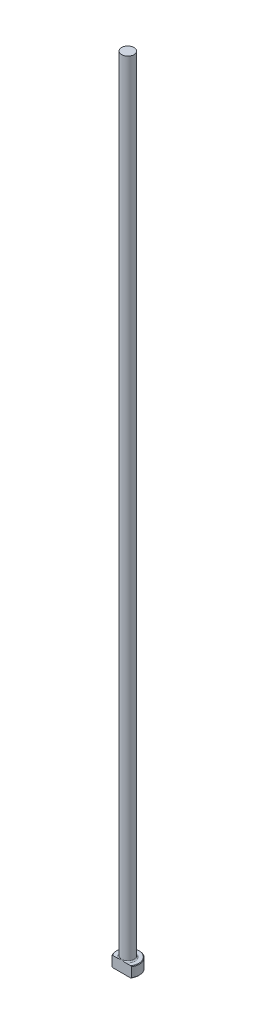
ISO-10303-21;
HEADER;
FILE_DESCRIPTION(('STEP AP214'),'2;1');
FILE_NAME('part.step','',(''),(''),'','','');
FILE_SCHEMA(('AUTOMOTIVE_DESIGN { 1 0 10303 214 1 1 1 1 }'));
ENDSEC;
DATA;
#1=APPLICATION_CONTEXT('core data for automotive mechanical design processes');
#2=APPLICATION_PROTOCOL_DEFINITION('international standard','automotive_design',2000,#1);
#3=PRODUCT_CONTEXT('',#1,'mechanical');
#4=PRODUCT('Part','Part','',(#3));
#5=PRODUCT_RELATED_PRODUCT_CATEGORY('part','',(#4));
#6=PRODUCT_DEFINITION_FORMATION('','',#4);
#7=PRODUCT_DEFINITION_CONTEXT('part definition',#1,'design');
#8=PRODUCT_DEFINITION('design','',#6,#7);
#9=PRODUCT_DEFINITION_SHAPE('','',#8);
#10=(LENGTH_UNIT() NAMED_UNIT(*) SI_UNIT(.MILLI.,.METRE.));
#11=(NAMED_UNIT(*) PLANE_ANGLE_UNIT() SI_UNIT($,.RADIAN.));
#12=(NAMED_UNIT(*) SI_UNIT($,.STERADIAN.) SOLID_ANGLE_UNIT());
#13=UNCERTAINTY_MEASURE_WITH_UNIT(LENGTH_MEASURE(1.E-05),#10,'distance_accuracy_value','');
#14=(GEOMETRIC_REPRESENTATION_CONTEXT(3) GLOBAL_UNCERTAINTY_ASSIGNED_CONTEXT((#13)) GLOBAL_UNIT_ASSIGNED_CONTEXT((#10,
#11,#12)) REPRESENTATION_CONTEXT('',''));
#15=CARTESIAN_POINT('',(0.,0.,0.));
#16=DIRECTION('',(0.,0.,1.));
#17=DIRECTION('',(1.,0.,0.));
#18=AXIS2_PLACEMENT_3D('',#15,#16,#17);
#19=CARTESIAN_POINT('',(0.,0.,0.));
#20=DIRECTION('',(0.,-1.,0.));
#21=DIRECTION('',(0.,0.,-1.));
#22=AXIS2_PLACEMENT_3D('',#19,#20,#21);
#23=PLANE('',#22);
#24=CARTESIAN_POINT('',(0.,0.,0.));
#25=DIRECTION('',(0.,-1.,0.));
#26=DIRECTION('',(0.,0.,-1.));
#27=AXIS2_PLACEMENT_3D('',#24,#25,#26);
#28=CIRCLE('',#27,4.90219999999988);
#29=CARTESIAN_POINT('',(-4.03944478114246,0.,2.77748999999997));
#30=VERTEX_POINT('',#29);
#31=CARTESIAN_POINT('',(4.03944478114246,0.,2.77748999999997));
#32=VERTEX_POINT('',#31);
#33=EDGE_CURVE('E98',#30,#32,#28,.T.);
#34=ORIENTED_EDGE('',*,*,#33,.T.);
#35=DIRECTION('',(-1.,0.,0.));
#36=VECTOR('',#35,1.);
#37=CARTESIAN_POINT('',(-4.34418550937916,0.,2.77748999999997));
#38=LINE('',#37,#36);
#39=EDGE_CURVE('E83',#32,#30,#38,.T.);
#40=ORIENTED_EDGE('',*,*,#39,.T.);
#41=EDGE_LOOP('',(#34,#40));
#42=FACE_BOUND('',#41,.T.);
#43=ADVANCED_FACE('F32',(#42),#23,.T.);
#44=CARTESIAN_POINT('',(0.,259.958771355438,0.));
#45=DIRECTION('',(0.,1.,0.));
#46=DIRECTION('',(0.,0.,1.));
#47=AXIS2_PLACEMENT_3D('',#44,#45,#46);
#48=CYLINDRICAL_SURFACE('',#47,5.15619999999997);
#49=CARTESIAN_POINT('',(0.,4.49580000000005,0.));
#50=DIRECTION('',(0.,1.,0.));
#51=DIRECTION('',(0.,0.,1.));
#52=AXIS2_PLACEMENT_3D('',#49,#50,#51);
#53=CIRCLE('',#52,5.15619999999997);
#54=CARTESIAN_POINT('',(-4.34418550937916,4.49580000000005,2.77748999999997));
#55=VERTEX_POINT('',#54);
#56=CARTESIAN_POINT('',(4.34418550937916,4.49580000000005,2.77748999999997));
#57=VERTEX_POINT('',#56);
#58=EDGE_CURVE('E104',#55,#57,#53,.F.);
#59=ORIENTED_EDGE('',*,*,#58,.T.);
#60=DIRECTION('',(0.,-1.,0.));
#61=VECTOR('',#60,1.);
#62=CARTESIAN_POINT('',(4.34418550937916,355.6,2.77748999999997));
#63=LINE('',#62,#61);
#64=CARTESIAN_POINT('',(4.34418550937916,0.254000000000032,2.77748999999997));
#65=VERTEX_POINT('',#64);
#66=EDGE_CURVE('E183',#57,#65,#63,.T.);
#67=ORIENTED_EDGE('',*,*,#66,.T.);
#68=CARTESIAN_POINT('',(0.,0.254000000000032,0.));
#69=DIRECTION('',(0.,-1.,0.));
#70=DIRECTION('',(0.,0.,-1.));
#71=AXIS2_PLACEMENT_3D('',#68,#69,#70);
#72=CIRCLE('',#71,5.15619999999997);
#73=CARTESIAN_POINT('',(-4.34418550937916,0.254000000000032,2.77748999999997));
#74=VERTEX_POINT('',#73);
#75=EDGE_CURVE('E100',#65,#74,#72,.F.);
#76=ORIENTED_EDGE('',*,*,#75,.T.);
#77=DIRECTION('',(0.,-1.,0.));
#78=VECTOR('',#77,1.);
#79=CARTESIAN_POINT('',(-4.34418550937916,355.6,2.77748999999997));
#80=LINE('',#79,#78);
#81=EDGE_CURVE('E93',#55,#74,#80,.T.);
#82=ORIENTED_EDGE('',*,*,#81,.F.);
#83=EDGE_LOOP('',(#59,#67,#76,#82));
#84=FACE_BOUND('',#83,.T.);
#85=ADVANCED_FACE('F158',(#84),#48,.T.);
#86=CARTESIAN_POINT('',(-5.15619999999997,4.7498,0.));
#87=DIRECTION('',(0.,1.,0.));
#88=DIRECTION('',(0.,0.,1.));
#89=AXIS2_PLACEMENT_3D('',#86,#87,#88);
#90=PLANE('',#89);
#91=CARTESIAN_POINT('',(0.,4.7498,0.));
#92=DIRECTION('',(0.,1.,0.));
#93=DIRECTION('',(0.,0.,1.));
#94=AXIS2_PLACEMENT_3D('',#91,#92,#93);
#95=CIRCLE('',#94,4.90220000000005);
#96=CARTESIAN_POINT('',(4.03944478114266,4.7498,2.77748999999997));
#97=VERTEX_POINT('',#96);
#98=CARTESIAN_POINT('',(-4.03944478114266,4.7498,2.77748999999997));
#99=VERTEX_POINT('',#98);
#100=EDGE_CURVE('E178',#97,#99,#95,.T.);
#101=ORIENTED_EDGE('',*,*,#100,.T.);
#102=DIRECTION('',(1.,0.,0.));
#103=VECTOR('',#102,1.);
#104=CARTESIAN_POINT('',(-5.15619999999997,4.7498,2.77748999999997));
#105=LINE('',#104,#103);
#106=CARTESIAN_POINT('',(-1.75499112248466,4.74979999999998,2.77748999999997));
#107=VERTEX_POINT('',#106);
#108=EDGE_CURVE('E57',#99,#107,#105,.T.);
#109=ORIENTED_EDGE('',*,*,#108,.T.);
#110=CARTESIAN_POINT('',(0.,4.7498,0.));
#111=DIRECTION('',(0.,1.,0.));
#112=DIRECTION('',(0.,0.,1.));
#113=AXIS2_PLACEMENT_3D('',#110,#111,#112);
#114=CIRCLE('',#113,3.28548999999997);
#115=CARTESIAN_POINT('',(1.75499112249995,4.74979999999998,2.77748999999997));
#116=VERTEX_POINT('',#115);
#117=EDGE_CURVE('E107',#107,#116,#114,.F.);
#118=ORIENTED_EDGE('',*,*,#117,.T.);
#119=EDGE_CURVE('E136',#116,#97,#105,.T.);
#120=ORIENTED_EDGE('',*,*,#119,.T.);
#121=EDGE_LOOP('',(#101,#109,#118,#120));
#122=FACE_BOUND('',#121,.T.);
#123=ADVANCED_FACE('F147',(#122),#90,.T.);
#124=CARTESIAN_POINT('',(0.,4.74980000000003,0.));
#125=DIRECTION('',(0.,-1.,0.));
#126=DIRECTION('',(0.,0.,-1.));
#127=AXIS2_PLACEMENT_3D('',#124,#125,#126);
#128=CONICAL_SURFACE('',#127,4.90220000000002,0.785398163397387);
#129=ORIENTED_EDGE('',*,*,#58,.F.);
#130=CARTESIAN_POINT('',(-9.55963531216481,-0.302952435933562,2.77748999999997));
#131=CARTESIAN_POINT('',(-9.37135034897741,-0.122152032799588,2.77748999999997));
#132=CARTESIAN_POINT('',(-9.18286469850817,0.0584399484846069,2.77748999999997));
#133=CARTESIAN_POINT('',(-8.80539641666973,0.419106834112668,2.77748999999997));
#134=CARTESIAN_POINT('',(-8.61641378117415,0.59918173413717,2.77748999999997));
#135=CARTESIAN_POINT('',(-8.23780363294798,0.958763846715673,2.77748999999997));
#136=CARTESIAN_POINT('',(-8.04817594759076,1.13827087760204,2.77748999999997));
#137=CARTESIAN_POINT('',(-7.66820393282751,1.49652400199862,2.77748999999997));
#138=CARTESIAN_POINT('',(-7.47785960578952,1.6752700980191,2.77748999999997));
#139=CARTESIAN_POINT('',(-7.09861750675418,2.02964380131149,2.77748999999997));
#140=CARTESIAN_POINT('',(-6.90973042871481,2.20528284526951,2.77748999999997));
#141=CARTESIAN_POINT('',(-6.53088645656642,2.55540305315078,2.77748999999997));
#142=CARTESIAN_POINT('',(-6.34092956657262,2.7298842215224,2.77748999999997));
#143=CARTESIAN_POINT('',(-5.95968564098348,3.07734070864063,2.77748999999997));
#144=CARTESIAN_POINT('',(-5.76839877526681,3.25031621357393,2.77748999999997));
#145=CARTESIAN_POINT('',(-5.38408554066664,3.59432147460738,2.77748999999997));
#146=CARTESIAN_POINT('',(-5.19105920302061,3.7653512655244,2.77748999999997));
#147=CARTESIAN_POINT('',(-4.84259460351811,4.06992471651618,2.77748999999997));
#148=CARTESIAN_POINT('',(-4.68757975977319,4.20395211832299,2.77748999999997));
#149=CARTESIAN_POINT('',(-4.37569692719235,4.46986504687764,2.77748999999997));
#150=CARTESIAN_POINT('',(-4.21882878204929,4.60175039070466,2.77748999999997));
#151=CARTESIAN_POINT('',(-3.90151974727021,4.86365914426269,2.77748999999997));
#152=CARTESIAN_POINT('',(-3.74106073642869,4.99366069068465,2.77748999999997));
#153=CARTESIAN_POINT('',(-3.41702456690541,5.249655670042,2.77748999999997));
#154=CARTESIAN_POINT('',(-3.25344811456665,5.37564999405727,2.77748999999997));
#155=CARTESIAN_POINT('',(-2.92018078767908,5.62344221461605,2.77748999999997));
#156=CARTESIAN_POINT('',(-2.75044139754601,5.74517569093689,2.77748999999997));
#157=CARTESIAN_POINT('',(-2.49133655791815,5.92141891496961,2.77748999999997));
#158=CARTESIAN_POINT('',(-2.40416054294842,5.97914279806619,2.77748999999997));
#159=CARTESIAN_POINT('',(-2.22809424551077,6.09190571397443,2.77748999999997));
#160=CARTESIAN_POINT('',(-2.13920410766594,6.14694497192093,2.77748999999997));
#161=CARTESIAN_POINT('',(-1.96016003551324,6.25324529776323,2.77748999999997));
#162=CARTESIAN_POINT('',(-1.87002259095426,6.30453380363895,2.77748999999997));
#163=CARTESIAN_POINT('',(-1.68751963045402,6.40295882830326,2.77748999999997));
#164=CARTESIAN_POINT('',(-1.5951537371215,6.45009463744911,2.77748999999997));
#165=CARTESIAN_POINT('',(-1.31465582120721,6.58349576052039,2.77748999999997));
#166=CARTESIAN_POINT('',(-1.12257968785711,6.66209225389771,2.77748999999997));
#167=CARTESIAN_POINT('',(-0.83201110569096,6.75391692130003,2.77748999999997));
#168=CARTESIAN_POINT('',(-0.737496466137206,6.77977348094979,2.77748999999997));
#169=CARTESIAN_POINT('',(-0.54647551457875,6.82278925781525,2.77748999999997));
#170=CARTESIAN_POINT('',(-0.449969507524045,6.83994979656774,2.77748999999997));
#171=CARTESIAN_POINT('',(-0.256218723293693,6.86436233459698,2.77748999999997));
#172=CARTESIAN_POINT('',(-0.158980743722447,6.87166730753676,2.77748999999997));
#173=CARTESIAN_POINT('',(0.0357279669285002,6.87598550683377,2.77748999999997));
#174=CARTESIAN_POINT('',(0.133198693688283,6.8729989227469,2.77748999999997));
#175=CARTESIAN_POINT('',(0.326944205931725,6.85699585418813,2.77748999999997));
#176=CARTESIAN_POINT('',(0.423222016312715,6.84401516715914,2.77748999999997));
#177=CARTESIAN_POINT('',(0.614119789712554,6.80897777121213,2.77748999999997));
#178=CARTESIAN_POINT('',(0.708739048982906,6.78691730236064,2.77748999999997));
#179=CARTESIAN_POINT('',(0.896435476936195,6.73483507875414,2.77748999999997));
#180=CARTESIAN_POINT('',(0.989497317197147,6.70475895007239,2.77748999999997));
#181=CARTESIAN_POINT('',(1.17322201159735,6.63810376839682,2.77748999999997));
#182=CARTESIAN_POINT('',(1.26388499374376,6.60152506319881,2.77748999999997));
#183=CARTESIAN_POINT('',(1.47746511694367,6.5079753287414,2.77748999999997));
#184=CARTESIAN_POINT('',(1.59931597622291,6.44858460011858,2.77748999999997));
#185=CARTESIAN_POINT('',(1.83913088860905,6.32236713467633,2.77748999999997));
#186=CARTESIAN_POINT('',(1.95709243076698,6.25553571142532,2.77748999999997));
#187=CARTESIAN_POINT('',(2.18997865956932,6.11622068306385,2.77748999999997));
#188=CARTESIAN_POINT('',(2.3048955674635,6.04372417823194,2.77748999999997));
#189=CARTESIAN_POINT('',(2.53196606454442,5.89460998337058,2.77748999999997));
#190=CARTESIAN_POINT('',(2.64412028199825,5.81799324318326,2.77748999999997));
#191=CARTESIAN_POINT('',(2.86729042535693,5.6608262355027,2.77748999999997));
#192=CARTESIAN_POINT('',(2.97828414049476,5.58024457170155,2.77748999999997));
#193=CARTESIAN_POINT('',(3.19840564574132,5.41657181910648,2.77748999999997));
#194=CARTESIAN_POINT('',(3.30753335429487,5.33348062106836,2.77748999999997));
#195=CARTESIAN_POINT('',(3.63230478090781,5.08151517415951,2.77748999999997));
#196=CARTESIAN_POINT('',(3.84567050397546,4.9097090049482,2.77748999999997));
#197=CARTESIAN_POINT('',(4.30277208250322,4.53251833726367,2.77748999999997));
#198=CARTESIAN_POINT('',(4.5457636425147,4.32624002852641,2.77748999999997));
#199=CARTESIAN_POINT('',(5.027896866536,3.9092109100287,2.77748999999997));
#200=CARTESIAN_POINT('',(5.26703820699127,3.69845972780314,2.77748999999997));
#201=CARTESIAN_POINT('',(5.74277905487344,3.27371644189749,2.77748999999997));
#202=CARTESIAN_POINT('',(5.97937625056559,3.05972175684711,2.77748999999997));
#203=CARTESIAN_POINT('',(6.45056510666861,2.62953458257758,2.77748999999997));
#204=CARTESIAN_POINT('',(6.68515674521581,2.41334206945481,2.77748999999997));
#205=CARTESIAN_POINT('',(7.14123520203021,1.99009092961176,2.77748999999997));
#206=CARTESIAN_POINT('',(7.36279506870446,1.78311090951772,2.77748999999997));
#207=CARTESIAN_POINT('',(7.80485250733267,1.36801517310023,2.77748999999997));
#208=CARTESIAN_POINT('',(8.02535006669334,1.1598994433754,2.77748999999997));
#209=CARTESIAN_POINT('',(8.46520134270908,0.743063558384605,2.77748999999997));
#210=CARTESIAN_POINT('',(8.68455621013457,0.534344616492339,2.77748999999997));
#211=CARTESIAN_POINT('',(9.12257454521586,0.116191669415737,2.77748999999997));
#212=CARTESIAN_POINT('',(9.34123802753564,-0.0932423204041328,2.77748999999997));
#213=CARTESIAN_POINT('',(9.55963531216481,-0.302952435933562,2.77748999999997));
#214=B_SPLINE_CURVE_WITH_KNOTS('',3,(#130,#131,#132,#133,#134,#135,#136,#137,#138,#139,#140,
#141,#142,#143,#144,#145,#146,#147,#148,#149,#150,#151,#152,#153,#154,#155,#156,#157,#158,#159,
#160,#161,#162,#163,#164,#165,#166,#167,#168,#169,#170,#171,#172,#173,#174,#175,#176,#177,#178,
#179,#180,#181,#182,#183,#184,#185,#186,#187,#188,#189,#190,#191,#192,#193,#194,#195,#196,#197,
#198,#199,#200,#201,#202,#203,#204,#205,#206,#207,#208,#209,#210,#211,#212,#213),.UNSPECIFIED.,
.F.,.F.,(4,2,2,2,2,2,2,2,2,2,2,2,2,2,2,2,2,2,2,2,2,2,2,2,2,2,2,2,2,2,2,2,2,2,2,2,2,2,2,2,2,4),
(0.,0.783109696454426,1.56622591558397,2.34957144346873,3.13291438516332,3.90669782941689,
4.68047829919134,5.45416168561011,6.22783120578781,6.84258177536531,7.45738456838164,
8.07687494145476,8.69622658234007,9.32265693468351,9.6362822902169,9.94988129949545,
10.2608915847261,10.5719549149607,11.1921677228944,11.4858060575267,11.7793997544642,
12.0714090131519,12.3634128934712,12.6543756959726,12.9454591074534,13.2385696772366,
13.531664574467,13.9379559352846,14.3445046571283,14.7520077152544,15.1594172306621,
15.5708539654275,15.9823086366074,16.8039855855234,17.7601331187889,18.7163605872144,
19.6733938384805,20.6304375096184,21.5400289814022,22.4496312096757,23.3579913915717,
24.2663321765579),.UNSPECIFIED.);
#215=EDGE_CURVE('E135',#55,#99,#214,.T.);
#216=ORIENTED_EDGE('',*,*,#215,.T.);
#217=ORIENTED_EDGE('',*,*,#100,.F.);
#218=EDGE_CURVE('E127',#97,#57,#214,.T.);
#219=ORIENTED_EDGE('',*,*,#218,.T.);
#220=EDGE_LOOP('',(#129,#216,#217,#219));
#221=FACE_BOUND('',#220,.T.);
#222=ADVANCED_FACE('F143',(#221),#128,.T.);
#223=CARTESIAN_POINT('',(0.,0.254000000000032,0.));
#224=DIRECTION('',(0.,1.,0.));
#225=DIRECTION('',(0.,0.,1.));
#226=AXIS2_PLACEMENT_3D('',#223,#224,#225);
#227=CONICAL_SURFACE('',#226,5.15619999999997,0.785398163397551);
#228=ORIENTED_EDGE('',*,*,#75,.F.);
#229=CARTESIAN_POINT('',(9.55963531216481,5.05275243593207,2.77748999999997));
#230=CARTESIAN_POINT('',(9.37135034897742,4.87195203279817,2.77748999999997));
#231=CARTESIAN_POINT('',(9.1828646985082,4.69136005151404,2.77748999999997));
#232=CARTESIAN_POINT('',(8.80539641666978,4.33069316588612,2.77748999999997));
#233=CARTESIAN_POINT('',(8.61641378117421,4.15061826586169,2.77748999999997));
#234=CARTESIAN_POINT('',(8.23780363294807,3.79103615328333,2.77748999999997));
#235=CARTESIAN_POINT('',(8.04817594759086,3.61152912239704,2.77748999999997));
#236=CARTESIAN_POINT('',(7.66820393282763,3.25327599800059,2.77748999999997));
#237=CARTESIAN_POINT('',(7.47785960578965,3.07452990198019,2.77748999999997));
#238=CARTESIAN_POINT('',(7.09861750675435,2.72015619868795,2.77748999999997));
#239=CARTESIAN_POINT('',(6.90973042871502,2.54451715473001,2.77748999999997));
#240=CARTESIAN_POINT('',(6.53088645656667,2.1943969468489,2.77748999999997));
#241=CARTESIAN_POINT('',(6.34092956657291,2.01991577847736,2.77748999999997));
#242=CARTESIAN_POINT('',(5.95968564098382,1.6724592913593,2.77748999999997));
#243=CARTESIAN_POINT('',(5.76839877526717,1.49948378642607,2.77748999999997));
#244=CARTESIAN_POINT('',(5.38408554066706,1.15547852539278,2.77748999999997));
#245=CARTESIAN_POINT('',(5.19105920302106,0.984448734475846,2.77748999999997));
#246=CARTESIAN_POINT('',(4.84259460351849,0.679875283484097,2.77748999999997));
#247=CARTESIAN_POINT('',(4.68757975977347,0.545847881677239,2.77748999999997));
#248=CARTESIAN_POINT('',(4.37569692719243,0.279934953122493,2.77748999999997));
#249=CARTESIAN_POINT('',(4.21882878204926,0.148049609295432,2.77748999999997));
#250=CARTESIAN_POINT('',(3.90151974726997,-0.113859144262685,2.77748999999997));
#251=CARTESIAN_POINT('',(3.74106073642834,-0.243860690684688,2.77748999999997));
#252=CARTESIAN_POINT('',(3.41702456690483,-0.499855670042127,2.77748999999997));
#253=CARTESIAN_POINT('',(3.25344811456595,-0.625849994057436,2.77748999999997));
#254=CARTESIAN_POINT('',(2.92018078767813,-0.873642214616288,2.77748999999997));
#255=CARTESIAN_POINT('',(2.75044139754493,-0.995375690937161,2.77748999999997));
#256=CARTESIAN_POINT('',(2.49133655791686,-1.17161891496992,2.77748999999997));
#257=CARTESIAN_POINT('',(2.40416054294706,-1.22934279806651,2.77748999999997));
#258=CARTESIAN_POINT('',(2.22809424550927,-1.34210571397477,2.77748999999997));
#259=CARTESIAN_POINT('',(2.13920410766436,-1.39714497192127,2.77748999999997));
#260=CARTESIAN_POINT('',(1.96016003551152,-1.50344529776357,2.77748999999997));
#261=CARTESIAN_POINT('',(1.87002259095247,-1.55473380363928,2.77748999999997));
#262=CARTESIAN_POINT('',(1.68751963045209,-1.65315882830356,2.77748999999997));
#263=CARTESIAN_POINT('',(1.59515373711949,-1.7002946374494,2.77748999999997));
#264=CARTESIAN_POINT('',(1.31465582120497,-1.83369576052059,2.77748999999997));
#265=CARTESIAN_POINT('',(1.12257968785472,-1.91229225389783,2.77748999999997));
#266=CARTESIAN_POINT('',(0.832011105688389,-2.00411692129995,2.77748999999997));
#267=CARTESIAN_POINT('',(0.737496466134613,-2.02997348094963,2.77748999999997));
#268=CARTESIAN_POINT('',(0.546475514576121,-2.07298925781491,2.77748999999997));
#269=CARTESIAN_POINT('',(0.449969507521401,-2.09014979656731,2.77748999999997));
#270=CARTESIAN_POINT('',(0.256218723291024,-2.11456233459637,2.77748999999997));
#271=CARTESIAN_POINT('',(0.158980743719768,-2.12186730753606,2.77748999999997));
#272=CARTESIAN_POINT('',(-0.0357279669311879,-2.12618550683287,2.77748999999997));
#273=CARTESIAN_POINT('',(-0.133198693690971,-2.12319892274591,2.77748999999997));
#274=CARTESIAN_POINT('',(-0.326944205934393,-2.10719585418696,2.77748999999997));
#275=CARTESIAN_POINT('',(-0.423222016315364,-2.09421516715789,2.77748999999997));
#276=CARTESIAN_POINT('',(-0.61411978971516,-2.05917777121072,2.77748999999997));
#277=CARTESIAN_POINT('',(-0.708739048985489,-2.03711730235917,2.77748999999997));
#278=CARTESIAN_POINT('',(-0.896435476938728,-1.98503507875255,2.77748999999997));
#279=CARTESIAN_POINT('',(-0.989497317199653,-1.95495895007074,2.77748999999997));
#280=CARTESIAN_POINT('',(-1.1732220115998,-1.88830376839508,2.77748999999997));
#281=CARTESIAN_POINT('',(-1.26388499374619,-1.85172506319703,2.77748999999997));
#282=CARTESIAN_POINT('',(-1.47746511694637,-1.7581753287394,2.77748999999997));
#283=CARTESIAN_POINT('',(-1.59931597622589,-1.69878460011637,2.77748999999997));
#284=CARTESIAN_POINT('',(-1.8391308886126,-1.57256713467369,2.77748999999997));
#285=CARTESIAN_POINT('',(-1.95709243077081,-1.50573571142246,2.77748999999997));
#286=CARTESIAN_POINT('',(-2.18997865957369,-1.36642068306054,2.77748999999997));
#287=CARTESIAN_POINT('',(-2.30489556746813,-1.2939241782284,2.77748999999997));
#288=CARTESIAN_POINT('',(-2.53196606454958,-1.14480998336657,2.77748999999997));
#289=CARTESIAN_POINT('',(-2.64412028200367,-1.06819324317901,2.77748999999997));
#290=CARTESIAN_POINT('',(-2.86729042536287,-0.911026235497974,2.77748999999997));
#291=CARTESIAN_POINT('',(-2.97828414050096,-0.83044457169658,2.77748999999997));
#292=CARTESIAN_POINT('',(-3.19840564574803,-0.666771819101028,2.77748999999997));
#293=CARTESIAN_POINT('',(-3.30753335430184,-0.583680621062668,2.77748999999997));
#294=CARTESIAN_POINT('',(-3.63230478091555,-0.331715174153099,2.77748999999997));
#295=CARTESIAN_POINT('',(-3.8456705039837,-0.159909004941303,2.77748999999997));
#296=CARTESIAN_POINT('',(-4.30277208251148,0.21728166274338,2.77748999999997));
#297=CARTESIAN_POINT('',(-4.54576364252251,0.423559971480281,2.77748999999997));
#298=CARTESIAN_POINT('',(-5.02789686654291,0.840589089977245,2.77748999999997));
#299=CARTESIAN_POINT('',(-5.26703820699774,1.05134027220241,2.77748999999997));
#300=CARTESIAN_POINT('',(-5.74277905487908,1.47608355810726,2.77748999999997));
#301=CARTESIAN_POINT('',(-5.97937625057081,1.69007824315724,2.77748999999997));
#302=CARTESIAN_POINT('',(-6.45056510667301,2.12026541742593,2.77748999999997));
#303=CARTESIAN_POINT('',(-6.68515674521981,2.33645793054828,2.77748999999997));
#304=CARTESIAN_POINT('',(-7.1412352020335,2.75970907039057,2.77748999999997));
#305=CARTESIAN_POINT('',(-7.36279506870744,2.96668909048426,2.77748999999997));
#306=CARTESIAN_POINT('',(-7.80485250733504,3.38178482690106,2.77748999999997));
#307=CARTESIAN_POINT('',(-8.02535006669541,3.58990055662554,2.77748999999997));
#308=CARTESIAN_POINT('',(-8.46520134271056,4.00673644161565,2.77748999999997));
#309=CARTESIAN_POINT('',(-8.68455621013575,4.21545538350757,2.77748999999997));
#310=CARTESIAN_POINT('',(-9.12257454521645,4.63360833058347,2.77748999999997));
#311=CARTESIAN_POINT('',(-9.34123802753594,4.84304232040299,2.77748999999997));
#312=CARTESIAN_POINT('',(-9.55963531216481,5.05275243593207,2.77748999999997));
#313=B_SPLINE_CURVE_WITH_KNOTS('',3,(#229,#230,#231,#232,#233,#234,#235,#236,#237,#238,#239,
#240,#241,#242,#243,#244,#245,#246,#247,#248,#249,#250,#251,#252,#253,#254,#255,#256,#257,#258,
#259,#260,#261,#262,#263,#264,#265,#266,#267,#268,#269,#270,#271,#272,#273,#274,#275,#276,#277,
#278,#279,#280,#281,#282,#283,#284,#285,#286,#287,#288,#289,#290,#291,#292,#293,#294,#295,#296,
#297,#298,#299,#300,#301,#302,#303,#304,#305,#306,#307,#308,#309,#310,#311,#312),.UNSPECIFIED.,
.F.,.F.,(4,2,2,2,2,2,2,2,2,2,2,2,2,2,2,2,2,2,2,2,2,2,2,2,2,2,2,2,2,2,2,2,2,2,2,2,2,2,2,2,2,4),
(0.,0.783109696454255,1.56622591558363,2.34957144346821,3.13291438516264,3.90669782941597,
4.68047829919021,5.45416168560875,6.22783120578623,6.84258177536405,7.45738456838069,
8.07687494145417,8.69622658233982,9.32265693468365,9.63628229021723,9.94988129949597,
10.2608915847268,10.5719549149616,11.1921677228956,11.4858060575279,11.7793997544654,
12.0714090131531,12.3634128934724,12.6543756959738,12.9454591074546,13.2385696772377,
13.5316645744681,13.9379559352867,14.3445046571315,14.7520077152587,15.1594172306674,
15.5708539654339,15.9823086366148,16.8039855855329,17.7601331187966,18.7163605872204,
19.6733938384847,20.6304375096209,21.5400289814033,22.4496312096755,23.3579913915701,
24.266332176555),.UNSPECIFIED.);
#314=EDGE_CURVE('E86',#65,#32,#313,.T.);
#315=ORIENTED_EDGE('',*,*,#314,.T.);
#316=ORIENTED_EDGE('',*,*,#33,.F.);
#317=EDGE_CURVE('E89',#30,#74,#313,.T.);
#318=ORIENTED_EDGE('',*,*,#317,.T.);
#319=EDGE_LOOP('',(#228,#315,#316,#318));
#320=FACE_BOUND('',#319,.T.);
#321=ADVANCED_FACE('F97',(#320),#227,.T.);
#322=CARTESIAN_POINT('',(0.,5.25779999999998,0.));
#323=DIRECTION('',(0.,1.,0.));
#324=DIRECTION('',(0.,0.,1.));
#325=AXIS2_PLACEMENT_3D('',#322,#323,#324);
#326=TOROIDAL_SURFACE('',#325,3.28548999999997,0.508);
#327=CARTESIAN_POINT('',(0.,5.25779999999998,2.77748999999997));
#328=CARTESIAN_POINT('',(-3.63482500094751E-11,5.25780081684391,2.77748999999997));
#329=CARTESIAN_POINT('',(1.58527088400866E-07,5.25780163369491,2.77748999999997));
#330=CARTESIAN_POINT('',(6.68759389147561E-07,5.2578032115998,2.77748999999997));
#331=CARTESIAN_POINT('',(1.02470275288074E-06,5.2578039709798,2.77748999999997));
#332=CARTESIAN_POINT('',(1.88230728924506E-06,5.25780548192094,2.77748999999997));
#333=CARTESIAN_POINT('',(2.39329363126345E-06,5.25780622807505,2.77748999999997));
#334=CARTESIAN_POINT('',(3.50054720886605E-06,5.25780764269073,2.77748999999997));
#335=CARTESIAN_POINT('',(4.09620351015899E-06,5.25780831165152,2.77748999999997));
#336=CARTESIAN_POINT('',(6.21505862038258E-06,5.25781052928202,2.77748999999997));
#337=CARTESIAN_POINT('',(7.84997964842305E-06,5.25781197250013,2.77748999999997));
#338=CARTESIAN_POINT('',(1.12461435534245E-05,5.25781456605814,2.77748999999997));
#339=CARTESIAN_POINT('',(1.30017650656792E-05,5.25781572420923,2.77748999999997));
#340=CARTESIAN_POINT('',(1.97830813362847E-05,5.25782001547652,2.77748999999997));
#341=CARTESIAN_POINT('',(2.49606936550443E-05,5.25782291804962,2.77748999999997));
#342=CARTESIAN_POINT('',(3.52264964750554E-05,5.25782772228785,2.77748999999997));
#343=CARTESIAN_POINT('',(4.02861099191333E-05,5.25782968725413,2.77748999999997));
#344=CARTESIAN_POINT('',(6.16428547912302E-05,5.25783793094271,2.77748999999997));
#345=CARTESIAN_POINT('',(7.79686338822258E-05,5.25784410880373,2.77748999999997));
#346=CARTESIAN_POINT('',(0.000108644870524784,5.2578541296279,2.77748999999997));
#347=CARTESIAN_POINT('',(0.000122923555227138,5.25785818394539,2.77748999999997));
#348=CARTESIAN_POINT('',(0.00022589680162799,5.25789001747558,2.77748999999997));
#349=CARTESIAN_POINT('',(0.000310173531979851,5.25793021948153,2.77748999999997));
#350=CARTESIAN_POINT('',(0.000636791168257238,5.25808026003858,2.77748999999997));
#351=CARTESIAN_POINT('',(0.00088220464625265,5.25818086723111,2.77748999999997));
#352=CARTESIAN_POINT('',(0.00183112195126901,5.25857573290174,2.77748999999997));
#353=CARTESIAN_POINT('',(0.00253146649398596,5.25887966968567,2.77748999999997));
#354=CARTESIAN_POINT('',(0.00538269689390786,5.26011107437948,2.77748999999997));
#355=CARTESIAN_POINT('',(0.00753706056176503,5.2610276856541,2.77748999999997));
#356=CARTESIAN_POINT('',(0.0523267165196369,5.2800917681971,2.77748999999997));
#357=CARTESIAN_POINT('',(0.0949226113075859,5.29836433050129,2.77748999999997));
#358=CARTESIAN_POINT('',(0.178660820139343,5.33400805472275,2.77748999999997));
#359=CARTESIAN_POINT('',(0.219799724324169,5.35138784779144,2.77748999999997));
#360=CARTESIAN_POINT('',(0.30692560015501,5.38783884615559,2.77748999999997));
#361=CARTESIAN_POINT('',(0.352927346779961,5.40687537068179,2.77748999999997));
#362=CARTESIAN_POINT('',(0.445632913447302,5.44454742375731,2.77748999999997));
#363=CARTESIAN_POINT('',(0.492339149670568,5.46317702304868,2.77748999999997));
#364=CARTESIAN_POINT('',(0.574123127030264,5.4949722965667,2.77748999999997));
#365=CARTESIAN_POINT('',(0.609129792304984,5.50832012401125,2.77748999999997));
#366=CARTESIAN_POINT('',(0.679265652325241,5.53442851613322,2.77748999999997));
#367=CARTESIAN_POINT('',(0.714394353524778,5.54719040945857,2.77748999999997));
#368=CARTESIAN_POINT('',(0.818611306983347,5.58395598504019,2.77748999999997));
#369=CARTESIAN_POINT('',(0.888033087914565,5.60703279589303,2.77748999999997));
#370=CARTESIAN_POINT('',(1.01885178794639,5.64701930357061,2.77748999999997));
#371=CARTESIAN_POINT('',(1.0801217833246,5.66434067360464,2.77748999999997));
#372=CARTESIAN_POINT('',(1.20389830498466,5.69582437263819,2.77748999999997));
#373=CARTESIAN_POINT('',(1.26641022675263,5.70996583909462,2.77748999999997));
#374=CARTESIAN_POINT('',(1.39563114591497,5.73475443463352,2.77748999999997));
#375=CARTESIAN_POINT('',(1.46238514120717,5.74517289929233,2.77748999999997));
#376=CARTESIAN_POINT('',(1.5964208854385,5.76016238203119,2.77748999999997));
#377=CARTESIAN_POINT('',(1.6637008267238,5.76474842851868,2.77748999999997));
#378=CARTESIAN_POINT('',(1.78334896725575,5.76633336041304,2.77748999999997));
#379=CARTESIAN_POINT('',(1.83569286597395,5.76479753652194,2.77748999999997));
#380=CARTESIAN_POINT('',(1.93953534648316,5.75634035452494,2.77748999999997));
#381=CARTESIAN_POINT('',(1.99103732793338,5.74946529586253,2.77748999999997));
#382=CARTESIAN_POINT('',(2.09352832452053,5.72907082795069,2.77748999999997));
#383=CARTESIAN_POINT('',(2.14449935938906,5.71545744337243,2.77748999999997));
#384=CARTESIAN_POINT('',(2.2436267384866,5.67996337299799,2.77748999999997));
#385=CARTESIAN_POINT('',(2.29178599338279,5.65809141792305,2.77748999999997));
#386=CARTESIAN_POINT('',(2.36178980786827,5.61652411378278,2.77748999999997));
#387=CARTESIAN_POINT('',(2.38569818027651,5.60030457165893,2.77748999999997));
#388=CARTESIAN_POINT('',(2.4309629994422,5.56461281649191,2.77748999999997));
#389=CARTESIAN_POINT('',(2.45232270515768,5.54514483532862,2.77748999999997));
#390=CARTESIAN_POINT('',(2.48830742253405,5.50626208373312,2.77748999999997));
#391=CARTESIAN_POINT('',(2.50346308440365,5.48734205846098,2.77748999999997));
#392=CARTESIAN_POINT('',(2.53047517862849,5.44726495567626,2.77748999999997));
#393=CARTESIAN_POINT('',(2.5423352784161,5.42611040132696,2.77748999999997));
#394=CARTESIAN_POINT('',(2.56038418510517,5.3854866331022,2.77748999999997));
#395=CARTESIAN_POINT('',(2.56717564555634,5.36628626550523,2.77748999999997));
#396=CARTESIAN_POINT('',(2.57744003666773,5.32701469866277,2.77748999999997));
#397=CARTESIAN_POINT('',(2.58091477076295,5.30694397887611,2.77748999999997));
#398=CARTESIAN_POINT('',(2.58430568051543,5.2664504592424,2.77748999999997));
#399=CARTESIAN_POINT('',(2.584213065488,5.24602691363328,2.77748999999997));
#400=CARTESIAN_POINT('',(2.5804545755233,5.20551288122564,2.77748999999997));
#401=CARTESIAN_POINT('',(2.57678819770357,5.18542244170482,2.77748999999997));
#402=CARTESIAN_POINT('',(2.56632842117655,5.14683425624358,2.77748999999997));
#403=CARTESIAN_POINT('',(2.55964787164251,5.12830543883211,2.77748999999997));
#404=CARTESIAN_POINT('',(2.54358717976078,5.09246829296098,2.77748999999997));
#405=CARTESIAN_POINT('',(2.53420613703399,5.07516037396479,2.77748999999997));
#406=CARTESIAN_POINT('',(2.50902920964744,5.03545005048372,2.77748999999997));
#407=CARTESIAN_POINT('',(2.49216203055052,5.01372616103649,2.77748999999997));
#408=CARTESIAN_POINT('',(2.45513239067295,4.97328752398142,2.77748999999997));
#409=CARTESIAN_POINT('',(2.43496232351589,4.95457992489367,2.77748999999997));
#410=CARTESIAN_POINT('',(2.38311067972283,4.912743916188,2.77748999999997));
#411=CARTESIAN_POINT('',(2.35019661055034,4.89114952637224,2.77748999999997));
#412=CARTESIAN_POINT('',(2.28149859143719,4.85339659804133,2.77748999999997));
#413=CARTESIAN_POINT('',(2.24571462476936,4.83723809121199,2.77748999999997));
#414=CARTESIAN_POINT('',(2.15091163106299,4.80145440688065,2.77748999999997));
#415=CARTESIAN_POINT('',(2.09057342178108,4.7853535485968,2.77748999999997));
#416=CARTESIAN_POINT('',(1.96762393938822,4.76220444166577,2.77748999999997));
#417=CARTESIAN_POINT('',(1.90499415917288,4.75526622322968,2.77748999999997));
#418=CARTESIAN_POINT('',(1.78440975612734,4.74902507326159,2.77748999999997));
#419=CARTESIAN_POINT('',(1.72647978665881,4.74915837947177,2.77748999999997));
#420=CARTESIAN_POINT('',(1.61075698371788,4.75449180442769,2.77748999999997));
#421=CARTESIAN_POINT('',(1.55296472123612,4.75970292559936,2.77748999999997));
#422=CARTESIAN_POINT('',(1.44056033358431,4.77392629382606,2.77748999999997));
#423=CARTESIAN_POINT('',(1.38592386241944,4.78275336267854,2.77748999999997));
#424=CARTESIAN_POINT('',(1.27754428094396,4.8034547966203,2.77748999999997));
#425=CARTESIAN_POINT('',(1.22379796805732,4.81531273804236,2.77748999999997));
#426=CARTESIAN_POINT('',(1.08372355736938,4.84970148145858,2.77748999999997));
#427=CARTESIAN_POINT('',(0.997900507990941,4.87428584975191,2.77748999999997));
#428=CARTESIAN_POINT('',(0.869412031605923,4.91500035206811,2.77748999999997));
#429=CARTESIAN_POINT('',(0.826169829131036,4.9293839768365,2.77748999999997));
#430=CARTESIAN_POINT('',(0.739936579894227,4.95921802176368,2.77748999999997));
#431=CARTESIAN_POINT('',(0.696946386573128,4.97467092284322,2.77748999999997));
#432=CARTESIAN_POINT('',(0.59684372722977,5.0117644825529,2.77748999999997));
#433=CARTESIAN_POINT('',(0.539854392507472,5.03373544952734,2.77748999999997));
#434=CARTESIAN_POINT('',(0.426869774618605,5.07852412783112,2.77748999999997));
#435=CARTESIAN_POINT('',(0.370870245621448,5.1013312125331,2.77748999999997));
#436=CARTESIAN_POINT('',(0.264915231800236,5.14523941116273,2.77748999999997));
#437=CARTESIAN_POINT('',(0.214932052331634,5.16627387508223,2.77748999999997));
#438=CARTESIAN_POINT('',(0.138912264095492,5.19849280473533,2.77748999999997));
#439=CARTESIAN_POINT('',(0.112835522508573,5.20958556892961,2.77748999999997));
#440=CARTESIAN_POINT('',(0.061077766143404,5.23169621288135,2.77748999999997));
#441=CARTESIAN_POINT('',(0.0353963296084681,5.24271296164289,2.77748999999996));
#442=CARTESIAN_POINT('',(0.00753653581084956,5.25457265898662,2.77748999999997));
#443=CARTESIAN_POINT('',(0.00538158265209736,5.25548941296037,2.77748999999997));
#444=CARTESIAN_POINT('',(0.00253020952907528,5.25672086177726,2.77748999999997));
#445=CARTESIAN_POINT('',(0.00183028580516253,5.25702462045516,2.77748999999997));
#446=CARTESIAN_POINT('',(0.000881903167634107,5.25741926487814,2.77748999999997));
#447=CARTESIAN_POINT('',(0.000636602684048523,5.25751982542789,2.77748999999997));
#448=CARTESIAN_POINT('',(0.000310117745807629,5.25766980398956,2.77748999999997));
#449=CARTESIAN_POINT('',(0.00022586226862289,5.2577099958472,2.77748999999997));
#450=CARTESIAN_POINT('',(0.000122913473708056,5.25774182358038,2.77748999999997));
#451=CARTESIAN_POINT('',(0.000108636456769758,5.25774587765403,2.77748999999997));
#452=CARTESIAN_POINT('',(7.79638534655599E-05,5.25775589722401,2.77748999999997));
#453=CARTESIAN_POINT('',(6.16399948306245E-05,5.25776207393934,2.77748999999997));
#454=CARTESIAN_POINT('',(4.02854070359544E-05,5.2577703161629,2.77748999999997));
#455=CARTESIAN_POINT('',(3.52260605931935E-05,5.25777228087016,2.77748999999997));
#456=CARTESIAN_POINT('',(2.49607548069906E-05,5.25777708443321,2.77748999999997));
#457=CARTESIAN_POINT('',(1.97833634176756E-05,5.25777998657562,2.77748999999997));
#458=CARTESIAN_POINT('',(1.30022515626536E-05,5.25778427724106,2.77748999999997));
#459=CARTESIAN_POINT('',(1.12466510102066E-05,5.25778543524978,2.77748999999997));
#460=CARTESIAN_POINT('',(7.85050041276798E-06,5.25778802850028,2.77748999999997));
#461=CARTESIAN_POINT('',(6.21557048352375E-06,5.25778947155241,2.77748999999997));
#462=CARTESIAN_POINT('',(4.0966688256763E-06,5.25779168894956,2.77748999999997));
#463=CARTESIAN_POINT('',(3.500992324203E-06,5.25779235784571,2.77748999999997));
#464=CARTESIAN_POINT('',(2.3936868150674E-06,5.25779377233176,2.77748999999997));
#465=CARTESIAN_POINT('',(1.88266863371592E-06,5.25779451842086,2.77748999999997));
#466=CARTESIAN_POINT('',(1.02498698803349E-06,5.25779602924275,2.77748999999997));
#467=CARTESIAN_POINT('',(6.6899975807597E-07,5.25779678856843,2.77748999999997));
#468=CARTESIAN_POINT('',(1.58661369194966E-07,5.25779836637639,2.77748999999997));
#469=CARTESIAN_POINT('',(3.63469769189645E-11,5.25779918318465,2.77748999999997));
#470=CARTESIAN_POINT('',(0.,5.25779999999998,2.77748999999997));
#471=B_SPLINE_CURVE_WITH_KNOTS('',3,(#327,#328,#329,#330,#331,#332,#333,#334,#335,#336,#337,
#338,#339,#340,#341,#342,#343,#344,#345,#346,#347,#348,#349,#350,#351,#352,#353,#354,#355,#356,
#357,#358,#359,#360,#361,#362,#363,#364,#365,#366,#367,#368,#369,#370,#371,#372,#373,#374,#375,
#376,#377,#378,#379,#380,#381,#382,#383,#384,#385,#386,#387,#388,#389,#390,#391,#392,#393,#394,
#395,#396,#397,#398,#399,#400,#401,#402,#403,#404,#405,#406,#407,#408,#409,#410,#411,#412,#413,
#414,#415,#416,#417,#418,#419,#420,#421,#422,#423,#424,#425,#426,#427,#428,#429,#430,#431,#432,
#433,#434,#435,#436,#437,#438,#439,#440,#441,#442,#443,#444,#445,#446,#447,#448,#449,#450,#451,
#452,#453,#454,#455,#456,#457,#458,#459,#460,#461,#462,#463,#464,#465,#466,#467,#468,#469,#470),
.UNSPECIFIED.,.T.,.F.,(4,2,2,2,2,2,2,2,2,2,2,2,2,2,2,2,2,2,2,2,2,2,2,2,2,2,2,2,2,2,2,2,2,2,2,2,
2,2,2,2,2,2,2,2,2,2,2,2,2,2,2,2,2,2,2,2,2,2,2,2,2,2,2,2,2,2,2,2,2,2,2,4),(0.,
2.44855601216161E-06,4.95233489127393E-06,7.65489052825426E-06,1.03388521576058E-05,
1.68491008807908E-05,2.31537100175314E-05,4.09008862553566E-05,5.71674519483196E-05,
0.000109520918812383,0.000154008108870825,0.000432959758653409,0.00122961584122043,
0.00351878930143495,0.0105437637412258,0.149576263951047,0.283557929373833,0.432909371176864,
0.583757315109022,0.696148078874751,0.808269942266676,1.02766943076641,1.21861436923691,
1.4107776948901,1.61326934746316,1.81523817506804,1.97211643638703,2.12764930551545,
2.28541514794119,2.44301466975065,2.52945892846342,2.61579143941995,2.68824272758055,
2.76061306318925,2.82144775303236,2.88224934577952,2.94320077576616,3.0041607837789,
3.0630067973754,3.12187245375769,3.20392380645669,3.28616684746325,3.40360419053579,
3.52104221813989,3.70735220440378,3.89587975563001,4.06940181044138,4.24330068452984,
4.40922866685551,4.57427590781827,4.84187326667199,4.97858134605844,5.11561799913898,
5.2988358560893,5.48022693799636,5.64291023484,5.72792677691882,5.81175121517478,
5.81877801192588,5.82106581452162,5.82186210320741,5.82214098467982,5.82218546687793,
5.82223781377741,5.82225407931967,5.82227182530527,5.82227812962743,5.82228463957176,
5.82228732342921,5.8222900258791,5.82229252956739,5.82229497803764),.UNSPECIFIED.);
#472=CARTESIAN_POINT('',(0.,5.25779999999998,2.77748999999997));
#473=VERTEX_POINT('',#472);
#474=EDGE_CURVE('E11',#116,#473,#471,.T.);
#475=ORIENTED_EDGE('',*,*,#474,.F.);
#476=ORIENTED_EDGE('',*,*,#117,.F.);
#477=CARTESIAN_POINT('',(0.,5.25779999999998,2.77748999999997));
#478=CARTESIAN_POINT('',(3.63482481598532E-11,5.25779918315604,2.77748999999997));
#479=CARTESIAN_POINT('',(-1.58527088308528E-07,5.25779836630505,2.77748999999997));
#480=CARTESIAN_POINT('',(-6.68759389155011E-07,5.25779678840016,2.77748999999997));
#481=CARTESIAN_POINT('',(-1.02470275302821E-06,5.25779602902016,2.77748999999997));
#482=CARTESIAN_POINT('',(-1.8823072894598E-06,5.25779451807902,2.77748999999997));
#483=CARTESIAN_POINT('',(-2.39329363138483E-06,5.2577937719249,2.77748999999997));
#484=CARTESIAN_POINT('',(-3.50054720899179E-06,5.25779235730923,2.77748999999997));
#485=CARTESIAN_POINT('',(-4.09620351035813E-06,5.25779168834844,2.77748999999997));
#486=CARTESIAN_POINT('',(-6.215058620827E-06,5.25778947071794,2.77748999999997));
#487=CARTESIAN_POINT('',(-7.84997964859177E-06,5.25778802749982,2.77748999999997));
#488=CARTESIAN_POINT('',(-1.12461435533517E-05,5.25778543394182,2.77748999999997));
#489=CARTESIAN_POINT('',(-1.30017650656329E-05,5.25778427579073,2.77748999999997));
#490=CARTESIAN_POINT('',(-1.97830813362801E-05,5.25777998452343,2.77748999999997));
#491=CARTESIAN_POINT('',(-2.49606936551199E-05,5.25777708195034,2.77748999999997));
#492=CARTESIAN_POINT('',(-3.52264964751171E-05,5.25777227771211,2.77748999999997));
#493=CARTESIAN_POINT('',(-4.02861099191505E-05,5.25777031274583,2.77748999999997));
#494=CARTESIAN_POINT('',(-6.16428547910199E-05,5.25776206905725,2.77748999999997));
#495=CARTESIAN_POINT('',(-7.79686338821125E-05,5.25775589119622,2.77748999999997));
#496=CARTESIAN_POINT('',(-0.000108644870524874,5.25774587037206,2.77748999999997));
#497=CARTESIAN_POINT('',(-0.000122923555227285,5.25774181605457,2.77748999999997));
#498=CARTESIAN_POINT('',(-0.000225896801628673,5.25770998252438,2.77748999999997));
#499=CARTESIAN_POINT('',(-0.000310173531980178,5.25766978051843,2.77748999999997));
#500=CARTESIAN_POINT('',(-0.000636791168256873,5.25751973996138,2.77748999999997));
#501=CARTESIAN_POINT('',(-0.00088220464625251,5.25741913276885,2.77748999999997));
#502=CARTESIAN_POINT('',(-0.00183112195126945,5.25702426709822,2.77748999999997));
#503=CARTESIAN_POINT('',(-0.00253146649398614,5.25672033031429,2.77748999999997));
#504=CARTESIAN_POINT('',(-0.00538269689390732,5.25548892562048,2.77748999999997));
#505=CARTESIAN_POINT('',(-0.00753706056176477,5.25457231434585,2.77748999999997));
#506=CARTESIAN_POINT('',(-0.0523267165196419,5.23550823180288,2.77748999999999));
#507=CARTESIAN_POINT('',(-0.0949226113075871,5.21723566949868,2.77748999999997));
#508=CARTESIAN_POINT('',(-0.178660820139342,5.1815919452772,2.77748999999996));
#509=CARTESIAN_POINT('',(-0.219799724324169,5.16421215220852,2.77748999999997));
#510=CARTESIAN_POINT('',(-0.306925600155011,5.12776115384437,2.77748999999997));
#511=CARTESIAN_POINT('',(-0.352927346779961,5.10872462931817,2.77748999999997));
#512=CARTESIAN_POINT('',(-0.445632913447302,5.07105257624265,2.77748999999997));
#513=CARTESIAN_POINT('',(-0.492339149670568,5.05242297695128,2.77748999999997));
#514=CARTESIAN_POINT('',(-0.574123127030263,5.02062770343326,2.77748999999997));
#515=CARTESIAN_POINT('',(-0.609129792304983,5.00727987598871,2.77748999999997));
#516=CARTESIAN_POINT('',(-0.67926565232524,4.98117148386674,2.77748999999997));
#517=CARTESIAN_POINT('',(-0.714394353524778,4.96840959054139,2.77748999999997));
#518=CARTESIAN_POINT('',(-0.818611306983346,4.93164401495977,2.77748999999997));
#519=CARTESIAN_POINT('',(-0.888033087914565,4.90856720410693,2.77748999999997));
#520=CARTESIAN_POINT('',(-1.01885178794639,4.86858069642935,2.77748999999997));
#521=CARTESIAN_POINT('',(-1.0801217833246,4.85125932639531,2.77748999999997));
#522=CARTESIAN_POINT('',(-1.20389830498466,4.81977562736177,2.77748999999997));
#523=CARTESIAN_POINT('',(-1.26641022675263,4.80563416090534,2.77748999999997));
#524=CARTESIAN_POINT('',(-1.39563114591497,4.78084556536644,2.77748999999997));
#525=CARTESIAN_POINT('',(-1.46238514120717,4.77042710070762,2.77748999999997));
#526=CARTESIAN_POINT('',(-1.5964208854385,4.75543761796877,2.77748999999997));
#527=CARTESIAN_POINT('',(-1.6637008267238,4.75085157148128,2.77748999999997));
#528=CARTESIAN_POINT('',(-1.78334896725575,4.74926663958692,2.77748999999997));
#529=CARTESIAN_POINT('',(-1.83569286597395,4.75080246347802,2.77748999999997));
#530=CARTESIAN_POINT('',(-1.93953534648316,4.75925964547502,2.77748999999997));
#531=CARTESIAN_POINT('',(-1.99103732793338,4.76613470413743,2.77748999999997));
#532=CARTESIAN_POINT('',(-2.09352832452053,4.78652917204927,2.77748999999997));
#533=CARTESIAN_POINT('',(-2.14449935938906,4.80014255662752,2.77748999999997));
#534=CARTESIAN_POINT('',(-2.2436267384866,4.83563662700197,2.77748999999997));
#535=CARTESIAN_POINT('',(-2.29178599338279,4.85750858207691,2.77748999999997));
#536=CARTESIAN_POINT('',(-2.36178980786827,4.89907588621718,2.77748999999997));
#537=CARTESIAN_POINT('',(-2.38569818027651,4.91529542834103,2.77748999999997));
#538=CARTESIAN_POINT('',(-2.4309629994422,4.95098718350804,2.77748999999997));
#539=CARTESIAN_POINT('',(-2.45232270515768,4.97045516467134,2.77748999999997));
#540=CARTESIAN_POINT('',(-2.48830742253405,5.00933791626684,2.77748999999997));
#541=CARTESIAN_POINT('',(-2.50346308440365,5.02825794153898,2.77748999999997));
#542=CARTESIAN_POINT('',(-2.53047517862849,5.0683350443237,2.77748999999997));
#543=CARTESIAN_POINT('',(-2.5423352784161,5.089489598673,2.77748999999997));
#544=CARTESIAN_POINT('',(-2.56038418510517,5.13011336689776,2.77748999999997));
#545=CARTESIAN_POINT('',(-2.56717564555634,5.14931373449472,2.77748999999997));
#546=CARTESIAN_POINT('',(-2.57744003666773,5.18858530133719,2.77748999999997));
#547=CARTESIAN_POINT('',(-2.58091477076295,5.20865602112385,2.77748999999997));
#548=CARTESIAN_POINT('',(-2.58430568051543,5.24914954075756,2.77748999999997));
#549=CARTESIAN_POINT('',(-2.584213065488,5.26957308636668,2.77748999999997));
#550=CARTESIAN_POINT('',(-2.5804545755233,5.31008711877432,2.77748999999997));
#551=CARTESIAN_POINT('',(-2.57678819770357,5.33017755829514,2.77748999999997));
#552=CARTESIAN_POINT('',(-2.56632842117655,5.36876574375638,2.77748999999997));
#553=CARTESIAN_POINT('',(-2.55964787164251,5.38729456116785,2.77748999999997));
#554=CARTESIAN_POINT('',(-2.54358717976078,5.42313170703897,2.77748999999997));
#555=CARTESIAN_POINT('',(-2.53420613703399,5.44043962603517,2.77748999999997));
#556=CARTESIAN_POINT('',(-2.50902920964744,5.48014994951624,2.77748999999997));
#557=CARTESIAN_POINT('',(-2.49216203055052,5.50187383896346,2.77748999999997));
#558=CARTESIAN_POINT('',(-2.45513239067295,5.54231247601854,2.77748999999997));
#559=CARTESIAN_POINT('',(-2.43496232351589,5.56102007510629,2.77748999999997));
#560=CARTESIAN_POINT('',(-2.38311067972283,5.60285608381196,2.77748999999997));
#561=CARTESIAN_POINT('',(-2.35019661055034,5.62445047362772,2.77748999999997));
#562=CARTESIAN_POINT('',(-2.28149859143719,5.66220340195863,2.77748999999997));
#563=CARTESIAN_POINT('',(-2.24571462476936,5.67836190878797,2.77748999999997));
#564=CARTESIAN_POINT('',(-2.15091163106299,5.71414559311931,2.77748999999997));
#565=CARTESIAN_POINT('',(-2.09057342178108,5.73024645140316,2.77748999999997));
#566=CARTESIAN_POINT('',(-1.96762393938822,5.75339555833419,2.77748999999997));
#567=CARTESIAN_POINT('',(-1.90499415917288,5.76033377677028,2.77748999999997));
#568=CARTESIAN_POINT('',(-1.78440975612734,5.76657492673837,2.77748999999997));
#569=CARTESIAN_POINT('',(-1.72647978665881,5.76644162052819,2.77748999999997));
#570=CARTESIAN_POINT('',(-1.61075698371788,5.76110819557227,2.77748999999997));
#571=CARTESIAN_POINT('',(-1.55296472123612,5.7558970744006,2.77748999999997));
#572=CARTESIAN_POINT('',(-1.44056033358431,5.7416737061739,2.77748999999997));
#573=CARTESIAN_POINT('',(-1.38592386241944,5.73284663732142,2.77748999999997));
#574=CARTESIAN_POINT('',(-1.27754428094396,5.71214520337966,2.77748999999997));
#575=CARTESIAN_POINT('',(-1.22379796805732,5.7002872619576,2.77748999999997));
#576=CARTESIAN_POINT('',(-1.08372355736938,5.66589851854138,2.77748999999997));
#577=CARTESIAN_POINT('',(-0.997900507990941,5.64131415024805,2.77748999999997));
#578=CARTESIAN_POINT('',(-0.869412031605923,5.60059964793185,2.77748999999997));
#579=CARTESIAN_POINT('',(-0.826169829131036,5.58621602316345,2.77748999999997));
#580=CARTESIAN_POINT('',(-0.739936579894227,5.55638197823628,2.77748999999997));
#581=CARTESIAN_POINT('',(-0.696946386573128,5.54092907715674,2.77748999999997));
#582=CARTESIAN_POINT('',(-0.59684372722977,5.50383551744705,2.77748999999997));
#583=CARTESIAN_POINT('',(-0.539854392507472,5.48186455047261,2.77748999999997));
#584=CARTESIAN_POINT('',(-0.426869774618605,5.43707587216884,2.77748999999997));
#585=CARTESIAN_POINT('',(-0.370870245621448,5.41426878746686,2.77748999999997));
#586=CARTESIAN_POINT('',(-0.264915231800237,5.37036058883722,2.77748999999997));
#587=CARTESIAN_POINT('',(-0.214932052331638,5.34932612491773,2.77748999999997));
#588=CARTESIAN_POINT('',(-0.138912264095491,5.31710719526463,2.77748999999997));
#589=CARTESIAN_POINT('',(-0.11283552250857,5.30601443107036,2.77748999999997));
#590=CARTESIAN_POINT('',(-0.061077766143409,5.2839037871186,2.77748999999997));
#591=CARTESIAN_POINT('',(-0.0353963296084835,5.27288703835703,2.77748999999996));
#592=CARTESIAN_POINT('',(-0.00753653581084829,5.26102734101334,2.77748999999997));
#593=CARTESIAN_POINT('',(-0.00538158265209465,5.26011058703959,2.77748999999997));
#594=CARTESIAN_POINT('',(-0.00253020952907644,5.2588791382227,2.77748999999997));
#595=CARTESIAN_POINT('',(-0.00183028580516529,5.25857537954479,2.77748999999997));
#596=CARTESIAN_POINT('',(-0.000881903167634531,5.25818073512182,2.77748999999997));
#597=CARTESIAN_POINT('',(-0.000636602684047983,5.25808017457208,2.77748999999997));
#598=CARTESIAN_POINT('',(-0.000310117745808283,5.2579301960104,2.77748999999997));
#599=CARTESIAN_POINT('',(-0.00022586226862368,5.25789000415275,2.77748999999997));
#600=CARTESIAN_POINT('',(-0.000122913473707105,5.25785817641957,2.77748999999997));
#601=CARTESIAN_POINT('',(-0.000108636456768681,5.25785412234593,2.77748999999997));
#602=CARTESIAN_POINT('',(-7.79638534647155E-05,5.25784410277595,2.77748999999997));
#603=CARTESIAN_POINT('',(-6.16399948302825E-05,5.25783792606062,2.77748999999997));
#604=CARTESIAN_POINT('',(-4.02854070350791E-05,5.25782968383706,2.77748999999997));
#605=CARTESIAN_POINT('',(-3.52260605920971E-05,5.2578277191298,2.77748999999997));
#606=CARTESIAN_POINT('',(-2.49607548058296E-05,5.25782291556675,2.77748999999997));
#607=CARTESIAN_POINT('',(-1.97833634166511E-05,5.25782001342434,2.77748999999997));
#608=CARTESIAN_POINT('',(-1.30022515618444E-05,5.25781572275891,2.77748999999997));
#609=CARTESIAN_POINT('',(-1.12466510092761E-05,5.25781456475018,2.77748999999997));
#610=CARTESIAN_POINT('',(-7.85050041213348E-06,5.25781197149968,2.77748999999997));
#611=CARTESIAN_POINT('',(-6.21557048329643E-06,5.25781052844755,2.77748999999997));
#612=CARTESIAN_POINT('',(-4.09666882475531E-06,5.2578083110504,2.77748999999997));
#613=CARTESIAN_POINT('',(-3.50099232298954E-06,5.25780764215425,2.77748999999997));
#614=CARTESIAN_POINT('',(-2.3936868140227E-06,5.25780622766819,2.77748999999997));
#615=CARTESIAN_POINT('',(-1.8826686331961E-06,5.2578054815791,2.77748999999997));
#616=CARTESIAN_POINT('',(-1.02498698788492E-06,5.2578039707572,2.77748999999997));
#617=CARTESIAN_POINT('',(-6.68999757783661E-07,5.25780321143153,2.77748999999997));
#618=CARTESIAN_POINT('',(-1.58661368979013E-07,5.25780163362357,2.77748999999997));
#619=CARTESIAN_POINT('',(-3.63469750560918E-11,5.2578008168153,2.77748999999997));
#620=CARTESIAN_POINT('',(0.,5.25779999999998,2.77748999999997));
#621=B_SPLINE_CURVE_WITH_KNOTS('',3,(#477,#478,#479,#480,#481,#482,#483,#484,#485,#486,#487,
#488,#489,#490,#491,#492,#493,#494,#495,#496,#497,#498,#499,#500,#501,#502,#503,#504,#505,#506,
#507,#508,#509,#510,#511,#512,#513,#514,#515,#516,#517,#518,#519,#520,#521,#522,#523,#524,#525,
#526,#527,#528,#529,#530,#531,#532,#533,#534,#535,#536,#537,#538,#539,#540,#541,#542,#543,#544,
#545,#546,#547,#548,#549,#550,#551,#552,#553,#554,#555,#556,#557,#558,#559,#560,#561,#562,#563,
#564,#565,#566,#567,#568,#569,#570,#571,#572,#573,#574,#575,#576,#577,#578,#579,#580,#581,#582,
#583,#584,#585,#586,#587,#588,#589,#590,#591,#592,#593,#594,#595,#596,#597,#598,#599,#600,#601,
#602,#603,#604,#605,#606,#607,#608,#609,#610,#611,#612,#613,#614,#615,#616,#617,#618,#619,#620),
.UNSPECIFIED.,.T.,.F.,(4,2,2,2,2,2,2,2,2,2,2,2,2,2,2,2,2,2,2,2,2,2,2,2,2,2,2,2,2,2,2,2,2,2,2,2,
2,2,2,2,2,2,2,2,2,2,2,2,2,2,2,2,2,2,2,2,2,2,2,2,2,2,2,2,2,2,2,2,2,2,2,4),(0.,
2.44855601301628E-06,4.95233489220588E-06,7.65489052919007E-06,1.03388521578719E-05,
1.68491008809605E-05,2.31537100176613E-05,4.09008862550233E-05,5.71674519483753E-05,
0.000109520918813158,0.000154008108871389,0.000432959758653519,0.00122961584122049,
0.00351878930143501,0.0105437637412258,0.149576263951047,0.283557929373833,0.432909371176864,
0.583757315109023,0.69614807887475,0.808269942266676,1.02766943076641,1.21861436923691,
1.4107776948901,1.61326934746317,1.81523817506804,1.97211643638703,2.12764930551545,
2.28541514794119,2.44301466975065,2.52945892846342,2.61579143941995,2.68824272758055,
2.76061306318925,2.82144775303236,2.88224934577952,2.94320077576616,3.0041607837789,
3.06300679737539,3.12187245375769,3.20392380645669,3.28616684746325,3.40360419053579,
3.52104221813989,3.70735220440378,3.89587975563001,4.06940181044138,4.24330068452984,
4.4092286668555,4.57427590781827,4.84187326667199,4.97858134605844,5.11561799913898,
5.2988358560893,5.48022693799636,5.64291023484,5.72792677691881,5.81175121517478,
5.81877801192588,5.82106581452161,5.82186210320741,5.82214098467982,5.82218546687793,
5.82223781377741,5.82225407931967,5.82227182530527,5.82227812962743,5.82228463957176,
5.82228732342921,5.8222900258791,5.82229252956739,5.82229497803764),.UNSPECIFIED.);
#622=EDGE_CURVE('E46',#473,#107,#621,.T.);
#623=ORIENTED_EDGE('',*,*,#622,.F.);
#624=CARTESIAN_POINT('',(0.,5.25779999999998,0.));
#625=DIRECTION('',(0.,1.,0.));
#626=DIRECTION('',(0.,0.,1.));
#627=AXIS2_PLACEMENT_3D('',#624,#625,#626);
#628=CIRCLE('',#627,2.77748999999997);
#629=EDGE_CURVE('E103',#473,#473,#628,.T.);
#630=ORIENTED_EDGE('',*,*,#629,.F.);
#631=EDGE_LOOP('',(#475,#476,#623,#630));
#632=FACE_BOUND('',#631,.T.);
#633=ADVANCED_FACE('F34',(#632),#326,.F.);
#634=CARTESIAN_POINT('',(0.,259.958771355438,0.));
#635=DIRECTION('',(0.,1.,0.));
#636=DIRECTION('',(0.,0.,1.));
#637=AXIS2_PLACEMENT_3D('',#634,#635,#636);
#638=CYLINDRICAL_SURFACE('',#637,2.77748999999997);
#639=ORIENTED_EDGE('',*,*,#629,.T.);
#640=EDGE_LOOP('',(#639));
#641=FACE_BOUND('',#640,.T.);
#642=CARTESIAN_POINT('',(0.,355.6,0.));
#643=DIRECTION('',(0.,1.,0.));
#644=DIRECTION('',(0.,0.,1.));
#645=AXIS2_PLACEMENT_3D('',#642,#643,#644);
#646=CIRCLE('',#645,2.77748999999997);
#647=CARTESIAN_POINT('',(0.,355.6,2.77748999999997));
#648=VERTEX_POINT('',#647);
#649=EDGE_CURVE('E101',#648,#648,#646,.T.);
#650=ORIENTED_EDGE('',*,*,#649,.F.);
#651=EDGE_LOOP('',(#650));
#652=FACE_BOUND('',#651,.T.);
#653=ADVANCED_FACE('F155',(#641,#652),#638,.T.);
#654=CARTESIAN_POINT('',(-2.77748999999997,355.6,0.));
#655=DIRECTION('',(0.,1.,0.));
#656=DIRECTION('',(0.,0.,1.));
#657=AXIS2_PLACEMENT_3D('',#654,#655,#656);
#658=PLANE('',#657);
#659=ORIENTED_EDGE('',*,*,#649,.T.);
#660=EDGE_LOOP('',(#659));
#661=FACE_BOUND('',#660,.T.);
#662=ADVANCED_FACE('F121',(#661),#658,.T.);
#663=CARTESIAN_POINT('',(-4.34418550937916,355.6,2.77748999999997));
#664=DIRECTION('',(0.,0.,1.));
#665=DIRECTION('',(1.,0.,0.));
#666=AXIS2_PLACEMENT_3D('',#663,#664,#665);
#667=PLANE('',#666);
#668=ORIENTED_EDGE('',*,*,#66,.F.);
#669=ORIENTED_EDGE('',*,*,#218,.F.);
#670=ORIENTED_EDGE('',*,*,#119,.F.);
#671=ORIENTED_EDGE('',*,*,#474,.T.);
#672=ORIENTED_EDGE('',*,*,#622,.T.);
#673=ORIENTED_EDGE('',*,*,#108,.F.);
#674=ORIENTED_EDGE('',*,*,#215,.F.);
#675=ORIENTED_EDGE('',*,*,#81,.T.);
#676=ORIENTED_EDGE('',*,*,#317,.F.);
#677=ORIENTED_EDGE('',*,*,#39,.F.);
#678=ORIENTED_EDGE('',*,*,#314,.F.);
#679=EDGE_LOOP('',(#668,#669,#670,#671,#672,#673,#674,#675,#676,#677,#678));
#680=FACE_BOUND('',#679,.T.);
#681=ADVANCED_FACE('F85',(#680),#667,.T.);
#682=CLOSED_SHELL('',(#43,#85,#123,#222,#321,#633,#653,#662,#681));
#683=MANIFOLD_SOLID_BREP('B2',#682);
#684=ADVANCED_BREP_SHAPE_REPRESENTATION('',(#18,#683),#14);
#685=SHAPE_DEFINITION_REPRESENTATION(#9,#684);
ENDSEC;
END-ISO-10303-21;
